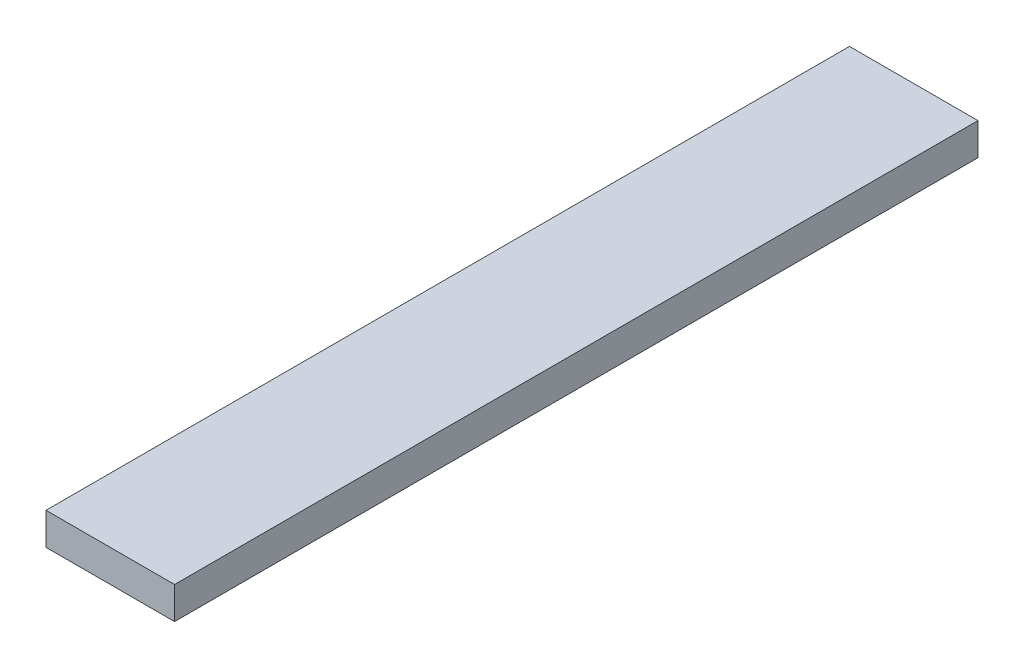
from build123d import *

# Parameters (mm, degrees)
ESQUISSE1_W      = 8
ESQUISSE1_H      = 2
EXTRUSION1_DEPTH = 50


with BuildPart() as part:
    # Esquisse1 → Extrusion1 (new body)
    with BuildSketch(Plane.XY):
        with Locations((4, 1)):
            Rectangle(ESQUISSE1_W, ESQUISSE1_H)
    extrude(amount=EXTRUSION1_DEPTH)


solid = part.part
